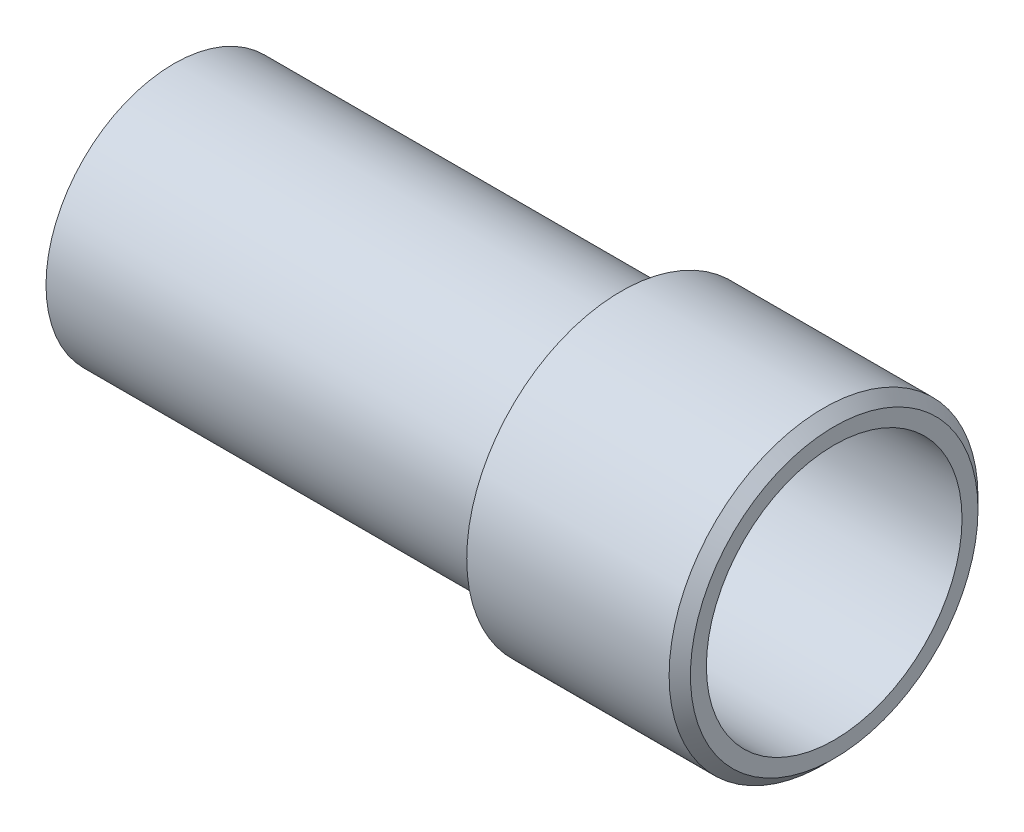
from build123d import *

# Parameters (mm, degrees)
CROQUIS1_R              = 7.25
CROQUIS1_R_2            = 6
SALIENTE_EXTRUIR1_DEPTH = 10
CHAFL_N1_SIZE           = 0.5
CROQUIS2_R              = 6
SALIENTE_EXTRUIR2_DEPTH = 21
CROQUIS7_R              = 2.5
CORTAR_EXTRUIR3_DEPTH   = 30


with BuildPart() as part:
    # Croquis1 → Saliente-Extruir1 (new body)
    with BuildSketch(Plane(origin=(0, 0, 0), x_dir=(0, 0, -1), z_dir=(1, 0, 0))):
        Circle(CROQUIS1_R)
        Circle(CROQUIS1_R_2, mode=Mode.SUBTRACT)
    extrude(amount=-SALIENTE_EXTRUIR1_DEPTH)

    # Chafl_n1
    chafl_n1_edges = [part.edges().sort_by_distance(p)[0] for p in [
        (0, 0, 7.25),
    ]]
    chamfer(chafl_n1_edges, length=CHAFL_N1_SIZE)


with BuildPart() as body_2:
    # Croquis2 → Saliente-Extruir2 (new body)
    with BuildSketch(Plane.ZY.offset(10)):
        with Locations(Location((0, 0, 0), (0, 0, 180))):
            Circle(CROQUIS2_R)
    extrude(amount=SALIENTE_EXTRUIR2_DEPTH)

    # Croquis7 → Cortar-Extruir3 (cut, symmetric)
    with BuildSketch(Plane(origin=(-10, 0, 0), x_dir=(0, 0, -1), z_dir=(1, 0, 0))):
        Circle(CROQUIS7_R)
    extrude(amount=CORTAR_EXTRUIR3_DEPTH, both=True, mode=Mode.SUBTRACT)


solid = Compound([part.part, body_2.part])
